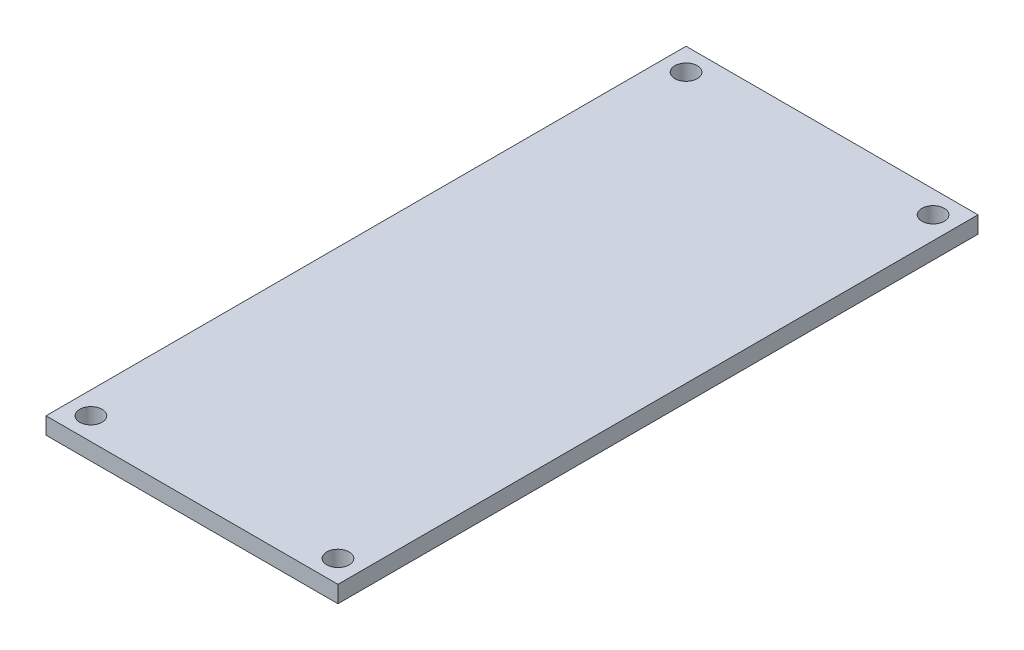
from build123d import *

# Parameters (mm, degrees)
SKETCH1_W           = 26
SKETCH1_H           = 57
SKETCH1_R           = 1
BOSS_EXTRUDE1_DEPTH = 1.5


with BuildPart() as part:
    # Sketch1 → Boss-Extrude1 (new body)
    with BuildSketch(Plane(origin=(0, 0, 0), x_dir=(1, 0, 0), z_dir=(0, 1, 0))):
        with Locations((13, 28.5)):
            Rectangle(SKETCH1_W, SKETCH1_H)
        with Locations(Location((24, 2, 0), (0, 0, 270))):
            Circle(SKETCH1_R, mode=Mode.SUBTRACT)
        with Locations(Location((2, 2, 0), (0, 0, 270))):
            Circle(SKETCH1_R, mode=Mode.SUBTRACT)
        with Locations(Location((2, 55, 0), (0, 0, 270))):
            Circle(SKETCH1_R, mode=Mode.SUBTRACT)
        with Locations(Location((24, 55, 0), (0, 0, 270))):
            Circle(SKETCH1_R, mode=Mode.SUBTRACT)
    extrude(amount=BOSS_EXTRUDE1_DEPTH)


solid = part.part
